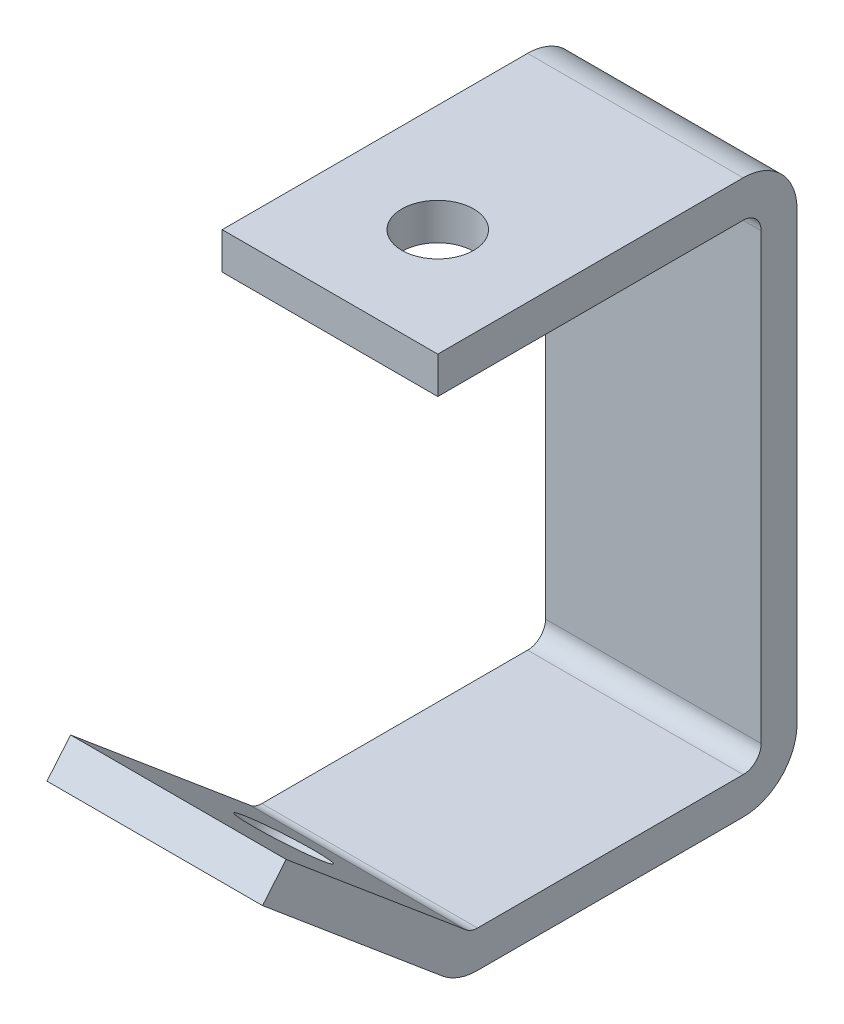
from build123d import *

# Parameters (mm, degrees)
LINEAR_AUSTRAGEN1_DEPTH                = 38.1
SKIZZE2_W                              = 38.1
SKIZZE2_H                              = 6.35
LINEAR_AUSTRAGEN2_DEPTH                = 91.35
SKIZZE3_W                              = 38.1
SKIZZE3_H                              = 6.5
LINEAR_AUSTRAGEN3_DEPTH                = 57.15
F_12_8_12_8_DURCHMESSER_BOHRUNG2_D     = 12.7
F_12_8_12_8_DURCHMESSER_BOHRUNG2_DEPTH = 6.5
VERRUNDUNG1_R                          = 3.175
VERRUNDUNG2_R                          = 3.175
VERRUNDUNG3_R                          = 3.175
VERRUNDUNG4_R                          = 9.525
VERRUNDUNG5_R                          = 9.525
VERRUNDUNG6_R                          = 9.525
SCHNITT_LINEAR_AUSTRAGEN1_REACH        = 140.142
SKIZZE9_R                              = 7


with BuildPart() as part:
    # Skizze1 → Linear austragen1 (new body)
    with BuildSketch(Plane(origin=(19.05, 0, 0), x_dir=(0, 0, -1), z_dir=(1, 0, 0))):
        Polygon((6.35, -6.5), (6.35, 0), (-51.284193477, 0), (-83.943880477, 27.404731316), (-88.12199994, 22.425442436), (-53.65, -6.5), align=None)
    extrude(amount=-LINEAR_AUSTRAGEN1_DEPTH)

    # Skizze2 → Linear austragen2 (add)
    with BuildSketch(Plane(origin=(0, 0, 0), x_dir=(-1, 0, 0), z_dir=(0, 1, 0))):
        with Locations((0, -3.175)):
            Rectangle(SKIZZE2_W, SKIZZE2_H)
    extrude(amount=LINEAR_AUSTRAGEN2_DEPTH)

    # Skizze3 → Linear austragen3 (add)
    with BuildSketch(Plane.XY):
        with Locations((0, 88.1)):
            Rectangle(SKIZZE3_W, SKIZZE3_H)
    extrude(amount=LINEAR_AUSTRAGEN3_DEPTH)

    # 12.8 _12.8_ Durchmesser Bohrung2
    with Locations(Plane(origin=(0, 91.35, 0), x_dir=(-1, 0, 0), z_dir=(0, 1, 0))):
        with Locations((0, 38.1)):
            Hole(F_12_8_12_8_DURCHMESSER_BOHRUNG2_D / 2, depth=F_12_8_12_8_DURCHMESSER_BOHRUNG2_DEPTH)

    # Verrundung1
    verrundung1_edges = [part.edges().sort_by_distance(p)[0] for p in [
        (0, 84.85, 0),
    ]]
    fillet(verrundung1_edges, radius=VERRUNDUNG1_R)

    # Verrundung2
    verrundung2_edges = [part.edges().sort_by_distance(p)[0] for p in [
        (0, 0, 51.284193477),
    ]]
    fillet(verrundung2_edges, radius=VERRUNDUNG2_R)

    # Verrundung3
    verrundung3_edges = [part.edges().sort_by_distance(p)[0] for p in [
        (0, 0, 0),
    ]]
    fillet(verrundung3_edges, radius=VERRUNDUNG3_R)

    # Verrundung4
    verrundung4_edges = [part.edges().sort_by_distance(p)[0] for p in [
        (0, -6.5, -6.35),
    ]]
    fillet(verrundung4_edges, radius=VERRUNDUNG4_R)

    # Verrundung5
    verrundung5_edges = [part.edges().sort_by_distance(p)[0] for p in [
        (0, 91.35, -6.35),
    ]]
    fillet(verrundung5_edges, radius=VERRUNDUNG5_R)

    # Verrundung6
    verrundung6_edges = [part.edges().sort_by_distance(p)[0] for p in [
        (0, -6.5, 53.65),
    ]]
    fillet(verrundung6_edges, radius=VERRUNDUNG6_R)

    # Skizze9 → Schnitt-Linear austragen1 (cut, up to next)
    with BuildSketch(Plane(origin=(0, -30.231824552, 25.367512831), x_dir=(1, 0, 0), z_dir=(0, -0.7660444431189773, 0.6427876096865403)), mode=Mode.PRIVATE) as schnitt_linear_austragen1_sk1:
        with Locations(Location((0, 57.629645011, 0), (0, 0, 270))):
            Circle(SKIZZE9_R)
    schnitt_linear_austragen1_tool1 = extrude(schnitt_linear_austragen1_sk1.sketch, amount=-SCHNITT_LINEAR_AUSTRAGEN1_REACH, mode=Mode.PRIVATE) & part.part
    add(schnitt_linear_austragen1_tool1.solids().sort_by_distance((0, 6.811797, 69.514382))[0], mode=Mode.SUBTRACT)


solid = part.part
